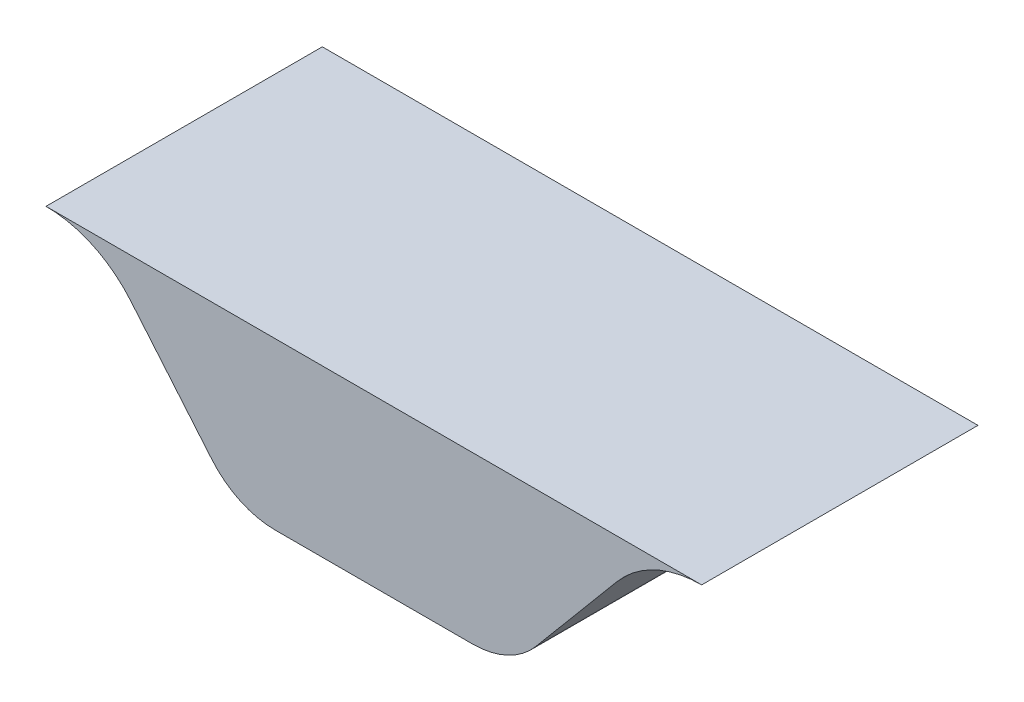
ISO-10303-21;
HEADER;
FILE_DESCRIPTION(('STEP AP214'),'2;1');
FILE_NAME('part.step','',(''),(''),'','','');
FILE_SCHEMA(('AUTOMOTIVE_DESIGN { 1 0 10303 214 1 1 1 1 }'));
ENDSEC;
DATA;
#1=APPLICATION_CONTEXT('core data for automotive mechanical design processes');
#2=APPLICATION_PROTOCOL_DEFINITION('international standard','automotive_design',2000,#1);
#3=PRODUCT_CONTEXT('',#1,'mechanical');
#4=PRODUCT('Part','Part','',(#3));
#5=PRODUCT_RELATED_PRODUCT_CATEGORY('part','',(#4));
#6=PRODUCT_DEFINITION_FORMATION('','',#4);
#7=PRODUCT_DEFINITION_CONTEXT('part definition',#1,'design');
#8=PRODUCT_DEFINITION('design','',#6,#7);
#9=PRODUCT_DEFINITION_SHAPE('','',#8);
#10=(LENGTH_UNIT() NAMED_UNIT(*) SI_UNIT(.MILLI.,.METRE.));
#11=(NAMED_UNIT(*) PLANE_ANGLE_UNIT() SI_UNIT($,.RADIAN.));
#12=(NAMED_UNIT(*) SI_UNIT($,.STERADIAN.) SOLID_ANGLE_UNIT());
#13=UNCERTAINTY_MEASURE_WITH_UNIT(LENGTH_MEASURE(1.E-05),#10,'distance_accuracy_value','');
#14=(GEOMETRIC_REPRESENTATION_CONTEXT(3) GLOBAL_UNCERTAINTY_ASSIGNED_CONTEXT((#13)) GLOBAL_UNIT_ASSIGNED_CONTEXT((#10,
#11,#12)) REPRESENTATION_CONTEXT('',''));
#15=CARTESIAN_POINT('',(0.,0.,0.));
#16=DIRECTION('',(0.,0.,1.));
#17=DIRECTION('',(1.,0.,0.));
#18=AXIS2_PLACEMENT_3D('',#15,#16,#17);
#19=CARTESIAN_POINT('',(-10.,0.,5.));
#20=DIRECTION('',(0.766044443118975,0.642787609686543,0.));
#21=DIRECTION('',(-0.642787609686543,0.766044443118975,0.));
#22=AXIS2_PLACEMENT_3D('',#19,#20,#21);
#23=PLANE('',#22);
#24=DIRECTION('',(0.642787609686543,-0.766044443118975,0.));
#25=VECTOR('',#24,1.);
#26=CARTESIAN_POINT('',(-10.,0.,5.));
#27=LINE('',#26,#25);
#28=CARTESIAN_POINT('',(-8.80105286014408,-1.42884956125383,5.));
#29=VERTEX_POINT('',#28);
#30=CARTESIAN_POINT('',(-5.8646125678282,-4.92836282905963,5.));
#31=VERTEX_POINT('',#30);
#32=EDGE_CURVE('E146',#29,#31,#27,.T.);
#33=ORIENTED_EDGE('',*,*,#32,.F.);
#34=DIRECTION('',(0.,0.,-1.));
#35=VECTOR('',#34,1.);
#36=CARTESIAN_POINT('',(-8.80105286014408,-1.42884956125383,5.));
#37=LINE('',#36,#35);
#38=CARTESIAN_POINT('',(-8.80105286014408,-1.42884956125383,-5.));
#39=VERTEX_POINT('',#38);
#40=EDGE_CURVE('E118',#29,#39,#37,.T.);
#41=ORIENTED_EDGE('',*,*,#40,.T.);
#42=DIRECTION('',(0.642787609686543,-0.766044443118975,0.));
#43=VECTOR('',#42,1.);
#44=CARTESIAN_POINT('',(-10.,0.,-5.));
#45=LINE('',#44,#43);
#46=CARTESIAN_POINT('',(-5.8646125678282,-4.92836282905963,-5.));
#47=VERTEX_POINT('',#46);
#48=EDGE_CURVE('E115',#39,#47,#45,.T.);
#49=ORIENTED_EDGE('',*,*,#48,.T.);
#50=DIRECTION('',(0.,0.,-1.));
#51=VECTOR('',#50,1.);
#52=CARTESIAN_POINT('',(-5.8646125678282,-4.92836282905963,5.));
#53=LINE('',#52,#51);
#54=EDGE_CURVE('E106',#47,#31,#53,.F.);
#55=ORIENTED_EDGE('',*,*,#54,.T.);
#56=EDGE_LOOP('',(#33,#41,#49,#55));
#57=FACE_BOUND('',#56,.T.);
#58=ADVANCED_FACE('F36',(#57),#23,.F.);
#59=CARTESIAN_POINT('',(-4.96540221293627,-6.,5.));
#60=DIRECTION('',(0.,1.,0.));
#61=DIRECTION('',(-1.,0.,0.));
#62=AXIS2_PLACEMENT_3D('',#59,#60,#61);
#63=PLANE('',#62);
#64=DIRECTION('',(1.,0.,0.));
#65=VECTOR('',#64,1.);
#66=CARTESIAN_POINT('',(-4.96540221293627,-6.,-5.));
#67=LINE('',#66,#65);
#68=CARTESIAN_POINT('',(-3.56647923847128,-6.,-5.));
#69=VERTEX_POINT('',#68);
#70=CARTESIAN_POINT('',(3.56647923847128,-6.,-5.));
#71=VERTEX_POINT('',#70);
#72=EDGE_CURVE('E136',#69,#71,#67,.T.);
#73=ORIENTED_EDGE('',*,*,#72,.T.);
#74=DIRECTION('',(0.,0.,-1.));
#75=VECTOR('',#74,1.);
#76=CARTESIAN_POINT('',(3.56647923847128,-6.,5.));
#77=LINE('',#76,#75);
#78=CARTESIAN_POINT('',(3.56647923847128,-6.,5.));
#79=VERTEX_POINT('',#78);
#80=EDGE_CURVE('E157',#71,#79,#77,.F.);
#81=ORIENTED_EDGE('',*,*,#80,.T.);
#82=DIRECTION('',(1.,0.,0.));
#83=VECTOR('',#82,1.);
#84=CARTESIAN_POINT('',(-4.96540221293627,-6.,5.));
#85=LINE('',#84,#83);
#86=CARTESIAN_POINT('',(-3.56647923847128,-6.,5.));
#87=VERTEX_POINT('',#86);
#88=EDGE_CURVE('E144',#87,#79,#85,.T.);
#89=ORIENTED_EDGE('',*,*,#88,.F.);
#90=DIRECTION('',(0.,0.,-1.));
#91=VECTOR('',#90,1.);
#92=CARTESIAN_POINT('',(-3.56647923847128,-6.,5.));
#93=LINE('',#92,#91);
#94=EDGE_CURVE('E154',#87,#69,#93,.T.);
#95=ORIENTED_EDGE('',*,*,#94,.T.);
#96=EDGE_LOOP('',(#73,#81,#89,#95));
#97=FACE_BOUND('',#96,.T.);
#98=ADVANCED_FACE('F177',(#97),#63,.F.);
#99=CARTESIAN_POINT('',(10.,0.,5.));
#100=DIRECTION('',(0.766044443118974,-0.642787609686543,0.));
#101=DIRECTION('',(0.642787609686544,0.766044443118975,0.));
#102=AXIS2_PLACEMENT_3D('',#99,#100,#101);
#103=PLANE('',#102);
#104=DIRECTION('',(-0.642787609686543,-0.766044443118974,0.));
#105=VECTOR('',#104,1.);
#106=CARTESIAN_POINT('',(10.,0.,-5.));
#107=LINE('',#106,#105);
#108=CARTESIAN_POINT('',(8.80105286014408,-1.42884956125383,-5.));
#109=VERTEX_POINT('',#108);
#110=CARTESIAN_POINT('',(5.8646125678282,-4.92836282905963,-5.));
#111=VERTEX_POINT('',#110);
#112=EDGE_CURVE('E139',#109,#111,#107,.T.);
#113=ORIENTED_EDGE('',*,*,#112,.F.);
#114=DIRECTION('',(0.,0.,-1.));
#115=VECTOR('',#114,1.);
#116=CARTESIAN_POINT('',(8.80105286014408,-1.42884956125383,5.));
#117=LINE('',#116,#115);
#118=CARTESIAN_POINT('',(8.80105286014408,-1.42884956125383,5.));
#119=VERTEX_POINT('',#118);
#120=EDGE_CURVE('E122',#109,#119,#117,.F.);
#121=ORIENTED_EDGE('',*,*,#120,.T.);
#122=DIRECTION('',(-0.642787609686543,-0.766044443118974,0.));
#123=VECTOR('',#122,1.);
#124=CARTESIAN_POINT('',(10.,0.,5.));
#125=LINE('',#124,#123);
#126=CARTESIAN_POINT('',(5.8646125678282,-4.92836282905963,5.));
#127=VERTEX_POINT('',#126);
#128=EDGE_CURVE('E114',#119,#127,#125,.T.);
#129=ORIENTED_EDGE('',*,*,#128,.T.);
#130=DIRECTION('',(0.,0.,-1.));
#131=VECTOR('',#130,1.);
#132=CARTESIAN_POINT('',(5.8646125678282,-4.92836282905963,-5.));
#133=LINE('',#132,#131);
#134=EDGE_CURVE('E148',#127,#111,#133,.T.);
#135=ORIENTED_EDGE('',*,*,#134,.T.);
#136=EDGE_LOOP('',(#113,#121,#129,#135));
#137=FACE_BOUND('',#136,.T.);
#138=ADVANCED_FACE('F38',(#137),#103,.T.);
#139=CARTESIAN_POINT('',(10.,0.,5.));
#140=DIRECTION('',(0.,0.,-1.));
#141=DIRECTION('',(-1.,0.,0.));
#142=AXIS2_PLACEMENT_3D('',#139,#140,#141);
#143=PLANE('',#142);
#144=ORIENTED_EDGE('',*,*,#88,.T.);
#145=CARTESIAN_POINT('',(3.56647923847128,-3.,5.));
#146=DIRECTION('',(0.,0.,-1.));
#147=DIRECTION('',(-1.,0.,0.));
#148=AXIS2_PLACEMENT_3D('',#145,#146,#147);
#149=CIRCLE('',#148,3.);
#150=EDGE_CURVE('E161',#79,#127,#149,.F.);
#151=ORIENTED_EDGE('',*,*,#150,.T.);
#152=ORIENTED_EDGE('',*,*,#128,.F.);
#153=CARTESIAN_POINT('',(11.86523063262,-4.,5.));
#154=DIRECTION('',(0.,0.,-1.));
#155=DIRECTION('',(-1.,0.,0.));
#156=AXIS2_PLACEMENT_3D('',#153,#154,#155);
#157=CIRCLE('',#156,4.);
#158=CARTESIAN_POINT('',(11.86523063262,0.,5.));
#159=VERTEX_POINT('',#158);
#160=EDGE_CURVE('E112',#119,#159,#157,.T.);
#161=ORIENTED_EDGE('',*,*,#160,.T.);
#162=DIRECTION('',(1.,0.,0.));
#163=VECTOR('',#162,1.);
#164=CARTESIAN_POINT('',(-10.,0.,5.));
#165=LINE('',#164,#163);
#166=CARTESIAN_POINT('',(-11.86523063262,0.,5.));
#167=VERTEX_POINT('',#166);
#168=EDGE_CURVE('E101',#167,#159,#165,.T.);
#169=ORIENTED_EDGE('',*,*,#168,.F.);
#170=CARTESIAN_POINT('',(-11.86523063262,-4.,5.));
#171=DIRECTION('',(0.,0.,-1.));
#172=DIRECTION('',(-1.,0.,0.));
#173=AXIS2_PLACEMENT_3D('',#170,#171,#172);
#174=CIRCLE('',#173,4.);
#175=EDGE_CURVE('E11',#167,#29,#174,.T.);
#176=ORIENTED_EDGE('',*,*,#175,.T.);
#177=ORIENTED_EDGE('',*,*,#32,.T.);
#178=CARTESIAN_POINT('',(-3.56647923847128,-3.,5.));
#179=DIRECTION('',(0.,0.,-1.));
#180=DIRECTION('',(-1.,0.,0.));
#181=AXIS2_PLACEMENT_3D('',#178,#179,#180);
#182=CIRCLE('',#181,3.);
#183=EDGE_CURVE('E159',#31,#87,#182,.F.);
#184=ORIENTED_EDGE('',*,*,#183,.T.);
#185=EDGE_LOOP('',(#144,#151,#152,#161,#169,#176,#177,#184));
#186=FACE_BOUND('',#185,.T.);
#187=ADVANCED_FACE('F109',(#186),#143,.F.);
#188=CARTESIAN_POINT('',(10.,0.,-5.));
#189=DIRECTION('',(0.,0.,-1.));
#190=DIRECTION('',(-1.,0.,0.));
#191=AXIS2_PLACEMENT_3D('',#188,#189,#190);
#192=PLANE('',#191);
#193=DIRECTION('',(1.,0.,0.));
#194=VECTOR('',#193,1.);
#195=CARTESIAN_POINT('',(-10.,0.,-5.));
#196=LINE('',#195,#194);
#197=CARTESIAN_POINT('',(-11.86523063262,0.,-5.));
#198=VERTEX_POINT('',#197);
#199=CARTESIAN_POINT('',(11.86523063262,0.,-5.));
#200=VERTEX_POINT('',#199);
#201=EDGE_CURVE('E104',#198,#200,#196,.T.);
#202=ORIENTED_EDGE('',*,*,#201,.T.);
#203=CARTESIAN_POINT('',(11.86523063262,-4.,-5.));
#204=DIRECTION('',(0.,0.,-1.));
#205=DIRECTION('',(-1.,0.,0.));
#206=AXIS2_PLACEMENT_3D('',#203,#204,#205);
#207=CIRCLE('',#206,4.);
#208=EDGE_CURVE('E121',#200,#109,#207,.F.);
#209=ORIENTED_EDGE('',*,*,#208,.T.);
#210=ORIENTED_EDGE('',*,*,#112,.T.);
#211=CARTESIAN_POINT('',(3.56647923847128,-3.,-5.));
#212=DIRECTION('',(0.,0.,-1.));
#213=DIRECTION('',(-1.,0.,0.));
#214=AXIS2_PLACEMENT_3D('',#211,#212,#213);
#215=CIRCLE('',#214,3.);
#216=EDGE_CURVE('E152',#111,#71,#215,.T.);
#217=ORIENTED_EDGE('',*,*,#216,.T.);
#218=ORIENTED_EDGE('',*,*,#72,.F.);
#219=CARTESIAN_POINT('',(-3.56647923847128,-3.,-5.));
#220=DIRECTION('',(0.,0.,-1.));
#221=DIRECTION('',(-1.,0.,0.));
#222=AXIS2_PLACEMENT_3D('',#219,#220,#221);
#223=CIRCLE('',#222,3.);
#224=EDGE_CURVE('E133',#69,#47,#223,.T.);
#225=ORIENTED_EDGE('',*,*,#224,.T.);
#226=ORIENTED_EDGE('',*,*,#48,.F.);
#227=CARTESIAN_POINT('',(-11.86523063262,-4.,-5.));
#228=DIRECTION('',(0.,0.,-1.));
#229=DIRECTION('',(-1.,0.,0.));
#230=AXIS2_PLACEMENT_3D('',#227,#228,#229);
#231=CIRCLE('',#230,4.);
#232=EDGE_CURVE('E44',#39,#198,#231,.F.);
#233=ORIENTED_EDGE('',*,*,#232,.T.);
#234=EDGE_LOOP('',(#202,#209,#210,#217,#218,#225,#226,#233));
#235=FACE_BOUND('',#234,.T.);
#236=ADVANCED_FACE('F129',(#235),#192,.T.);
#237=CARTESIAN_POINT('',(3.56647923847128,-3.,5.));
#238=DIRECTION('',(0.,0.,1.));
#239=DIRECTION('',(1.,0.,0.));
#240=AXIS2_PLACEMENT_3D('',#237,#238,#239);
#241=CYLINDRICAL_SURFACE('',#240,3.);
#242=ORIENTED_EDGE('',*,*,#150,.F.);
#243=ORIENTED_EDGE('',*,*,#80,.F.);
#244=ORIENTED_EDGE('',*,*,#216,.F.);
#245=ORIENTED_EDGE('',*,*,#134,.F.);
#246=EDGE_LOOP('',(#242,#243,#244,#245));
#247=FACE_BOUND('',#246,.T.);
#248=ADVANCED_FACE('F174',(#247),#241,.T.);
#249=CARTESIAN_POINT('',(-3.56647923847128,-3.,5.));
#250=DIRECTION('',(0.,0.,-1.));
#251=DIRECTION('',(-1.,0.,0.));
#252=AXIS2_PLACEMENT_3D('',#249,#250,#251);
#253=CYLINDRICAL_SURFACE('',#252,3.);
#254=ORIENTED_EDGE('',*,*,#183,.F.);
#255=ORIENTED_EDGE('',*,*,#54,.F.);
#256=ORIENTED_EDGE('',*,*,#224,.F.);
#257=ORIENTED_EDGE('',*,*,#94,.F.);
#258=EDGE_LOOP('',(#254,#255,#256,#257));
#259=FACE_BOUND('',#258,.T.);
#260=ADVANCED_FACE('F182',(#259),#253,.T.);
#261=CARTESIAN_POINT('',(11.86523063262,-4.,25.));
#262=DIRECTION('',(0.,0.,1.));
#263=DIRECTION('',(1.,0.,0.));
#264=AXIS2_PLACEMENT_3D('',#261,#262,#263);
#265=CYLINDRICAL_SURFACE('',#264,4.);
#266=ORIENTED_EDGE('',*,*,#160,.F.);
#267=ORIENTED_EDGE('',*,*,#120,.F.);
#268=ORIENTED_EDGE('',*,*,#208,.F.);
#269=DIRECTION('',(0.,0.,-1.));
#270=VECTOR('',#269,1.);
#271=CARTESIAN_POINT('',(11.86523063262,0.,-5.));
#272=LINE('',#271,#270);
#273=EDGE_CURVE('E105',#159,#200,#272,.T.);
#274=ORIENTED_EDGE('',*,*,#273,.F.);
#275=EDGE_LOOP('',(#266,#267,#268,#274));
#276=FACE_BOUND('',#275,.T.);
#277=ADVANCED_FACE('F165',(#276),#265,.F.);
#278=CARTESIAN_POINT('',(-11.86523063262,-4.,5.));
#279=DIRECTION('',(0.,0.,-1.));
#280=DIRECTION('',(-1.,0.,0.));
#281=AXIS2_PLACEMENT_3D('',#278,#279,#280);
#282=CYLINDRICAL_SURFACE('',#281,4.);
#283=ORIENTED_EDGE('',*,*,#175,.F.);
#284=DIRECTION('',(0.,0.,-1.));
#285=VECTOR('',#284,1.);
#286=CARTESIAN_POINT('',(-11.86523063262,0.,25.));
#287=LINE('',#286,#285);
#288=EDGE_CURVE('E99',#198,#167,#287,.F.);
#289=ORIENTED_EDGE('',*,*,#288,.F.);
#290=ORIENTED_EDGE('',*,*,#232,.F.);
#291=ORIENTED_EDGE('',*,*,#40,.F.);
#292=EDGE_LOOP('',(#283,#289,#290,#291));
#293=FACE_BOUND('',#292,.T.);
#294=ADVANCED_FACE('F117',(#293),#282,.F.);
#295=CARTESIAN_POINT('',(-25.,0.,25.));
#296=DIRECTION('',(0.,-1.,0.));
#297=DIRECTION('',(0.,0.,-1.));
#298=AXIS2_PLACEMENT_3D('',#295,#296,#297);
#299=PLANE('',#298);
#300=ORIENTED_EDGE('',*,*,#273,.T.);
#301=ORIENTED_EDGE('',*,*,#201,.F.);
#302=ORIENTED_EDGE('',*,*,#288,.T.);
#303=ORIENTED_EDGE('',*,*,#168,.T.);
#304=EDGE_LOOP('',(#300,#301,#302,#303));
#305=FACE_BOUND('',#304,.T.);
#306=ADVANCED_FACE('F100',(#305),#299,.F.);
#307=CLOSED_SHELL('',(#58,#98,#138,#187,#236,#248,#260,#277,#294,#306));
#308=MANIFOLD_SOLID_BREP('B2',#307);
#309=ADVANCED_BREP_SHAPE_REPRESENTATION('',(#18,#308),#14);
#310=SHAPE_DEFINITION_REPRESENTATION(#9,#309);
ENDSEC;
END-ISO-10303-21;
